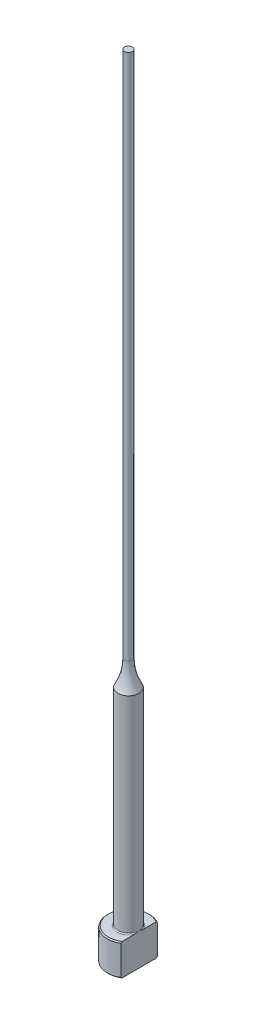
from build123d import *
from build123d.topology import SkipClean

# Parameters (mm, degrees)
CHAMFER1_SIZE    = 0.2
FILLET1_R        = 0.2
KEYED_HEAD_DEPTH = 151.106628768


with BuildPart() as part:
    # Sketch1 → Revolve1 (revolve)
    with BuildSketch(Plane.XY, mode=Mode.PRIVATE) as revolve1_sk:
        with BuildLine():
            Line((0, 0), (-4, 0))
            Line((-4, 0), (-4, 6))
            Line((-4, 6), (-2, 6))
            Line((-2, 6), (-2, 45.158770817))
            ThreePointArc((-2, 45.158770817), (-1.067541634, 47.5), (-0.75, 50))
            Line((-0.75, 50), (-0.75, 150))
            Line((-0.75, 150), (0, 150))
            Line((0, 150), (0, 0))
        make_face()
    revolve(revolve1_sk.sketch.rotate(Axis((0, 259.958771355, 0), (0, -1, 0)), 270), axis=Axis((0, 259.958771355, 0), (0, -1, 0)))

    # Chamfer1
    chamfer1_edges = [part.edges().sort_by_distance(p)[0] for p in [
        (0, 0, -4),
        (0, 6, -4),
    ]]
    chamfer(chamfer1_edges, length=CHAMFER1_SIZE)

    # Fillet1
    fillet1_edges = [part.edges().sort_by_distance(p)[0] for p in [
        (0, 6, -2),
    ]]
    fillet(fillet1_edges, radius=FILLET1_R)

    # Sketch2 → Keyed Head (cut, through all)
    with SkipClean():  # the faces are left unmerged after this step: merging them gives an invalid solid
        with BuildSketch(Plane(origin=(0, 0, 0), x_dir=(1, 0, 0), z_dir=(0, 1, 0))):
            with BuildLine():
                Line((2, -3.464101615), (2, 3.464101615))
                ThreePointArc((2, 3.464101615), (4, 0), (2, -3.464101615))
            make_face()
        extrude(amount=KEYED_HEAD_DEPTH, mode=Mode.SUBTRACT)


solid = part.part
